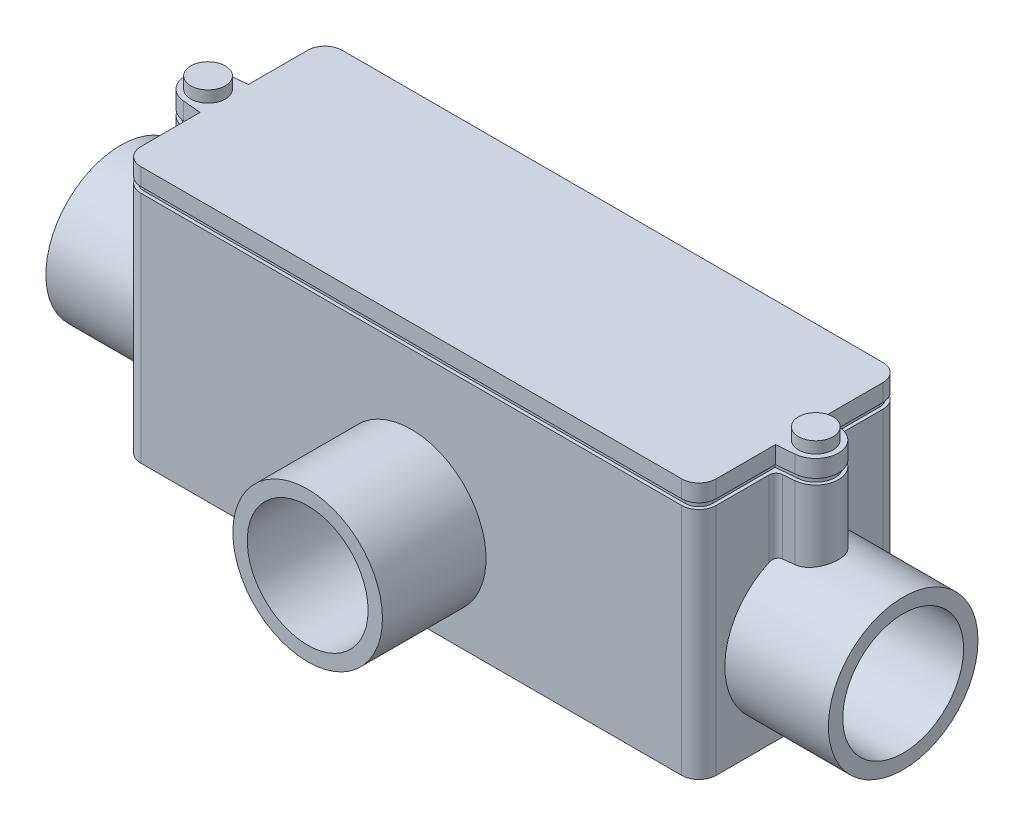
from build123d import *

# Parameters (mm, degrees)
SKETCH2_W                        = 127
SKETCH2_H                        = 44.45
BASE_EXTRUDE_DEPTH               = 51.6128
FILLET1_R                        = 3.81
SHELL1_T                         = -3.556
SKETCH1_R                        = 16.51
CONDUITBOSS_EXTRUDE1_DEPTH       = 22.86
COVERSCREWBOSS_EXTRUDE6_DEPTH    = 20
SKETCH18_R                       = 16.51
SIDECONDUITBOSS_EXTRUDE2_DEPTH   = 22.86
SKETCH10_R                       = 13.335
CONDUITSOCKET_CUT_EXTRUDE4_DEPTH = 19.8374
SKETCH16_R                       = 10.795
THRUDIA_CUT_EXTRUDE7_DEPTH       = 126.4666
SKETCH19_R                       = 13.335
CUT_EXTRUDE1_DEPTH               = 19.8374
SKETCH20_R                       = 10.795
CUT_EXTRUDE2_DEPTH               = 6.5786
FILLET2_R                        = 1.524
EXTRUDE2_DEPTH                   = 1.27
EXTRUDE3_START                   = 3.81
EXTRUDE3_DEPTH                   = 3.81
SKETCH25_R                       = 3.81
EXTRUDE4_DEPTH                   = 2.54


with BuildPart() as part:
    # Sketch2 → Base-Extrude (new body)
    with BuildSketch(Plane(origin=(0, 0, 0), x_dir=(1, 0, 0), z_dir=(0, 1, 0))):
        Rectangle(SKETCH2_W, SKETCH2_H)
    extrude(amount=BASE_EXTRUDE_DEPTH)

    # Fillet1
    fillet1_edges = [part.edges().sort_by_distance(p)[0] for p in [
        (-63.5, 25.8064, -22.225),
        (63.5, 25.8064, -22.225),
        (63.5, 25.8064, 22.225),
        (-63.5, 25.8064, 22.225),
    ]]
    fillet(fillet1_edges, radius=FILLET1_R)

    # Shell1
    shell1_openings = [part.faces().sort_by_distance(p)[0] for p in [
        (0, 51.6128, 0),
    ]]
    offset(amount=SHELL1_T, openings=shell1_openings, kind=Kind.INTERSECTION)

    # Sketch1 → ConduitBoss-Extrude1 (add)
    with BuildSketch(Plane(origin=(63.5, 0, 0), x_dir=(0, 0, -1), z_dir=(1, 0, 0))):
        with Locations(Location((0, 19.812, 0), (0, 0, 180))):
            Circle(SKETCH1_R)
    conduitboss_extrude1 = extrude(amount=CONDUITBOSS_EXTRUDE1_DEPTH)

    # Sketch5 → CoverScrewBoss-Extrude6 (add)
    with BuildSketch(Plane(origin=(0, 51.6128, 0), x_dir=(-1, 0, 0), z_dir=(0, 1, 0))):
        with BuildLine():
            Line((-63.5, -5.334), (-63.5, 5.334))
            Line((-63.5, 5.334), (-67.507785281, 4.980683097))
            ThreePointArc((-67.507785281, 4.980683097), (-72.0687, 0), (-67.507785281, -4.980683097))
            Line((-67.507785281, -4.980683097), (-63.5, -5.334))
        make_face()
        with BuildLine():
            Line((63.5, 5.334), (67.507785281, 4.980683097))
            ThreePointArc((67.507785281, 4.980683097), (72.0687, 0), (67.507785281, -4.980683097))
            Line((67.507785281, -4.980683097), (63.5, -5.334))
            Line((63.5, -5.334), (63.5, 5.334))
        make_face()
    extrude(amount=-COVERSCREWBOSS_EXTRUDE6_DEPTH)

    # Sketch18 → SideConduitBoss-Extrude2 (add)
    with BuildSketch(Plane.XY.offset(22.225)):
        with Locations(Location((0, 19.812, 0), (0, 0, 180))):
            Circle(SKETCH18_R)
    extrude(amount=SIDECONDUITBOSS_EXTRUDE2_DEPTH)

    # Sketch10 → ConduitSocket-Cut-Extrude4 (cut)
    with BuildSketch(Plane(origin=(86.36, 0, 0), x_dir=(0, 0, -1), z_dir=(1, 0, 0))):
        with Locations((0, 19.812)):
            Circle(SKETCH10_R)
    conduitsocket_cut_extrude4 = extrude(amount=-CONDUITSOCKET_CUT_EXTRUDE4_DEPTH, mode=Mode.SUBTRACT)

    # Sketch16 → ThruDia-Cut-Extrude7 (cut)
    with BuildSketch(Plane.YZ.offset(66.5226)):
        with Locations(Location((19.812, 0, 0), (0, 0, 270))):
            Circle(SKETCH16_R)
    thrudia_cut_extrude7 = extrude(amount=-THRUDIA_CUT_EXTRUDE7_DEPTH, mode=Mode.SUBTRACT)

    # Mirror1: ConduitBoss-Extrude1, ConduitSocket-Cut-Extrude4, ThruDia-Cut-Extrude7 across plane
    add(conduitboss_extrude1.mirror(Plane(origin=(0, 0, 0), x_dir=(0, 0, 1), z_dir=(1, 0, 0))))
    add(conduitsocket_cut_extrude4.mirror(Plane(origin=(0, 0, 0), x_dir=(0, 0, 1), z_dir=(1, 0, 0))), mode=Mode.SUBTRACT)
    add(thrudia_cut_extrude7.mirror(Plane(origin=(0, 0, 0), x_dir=(0, 0, 1), z_dir=(1, 0, 0))), mode=Mode.SUBTRACT)

    # Sketch19 → Cut-Extrude1 (cut)
    with BuildSketch(Plane.XY.offset(45.085)):
        with Locations((0, 19.812)):
            Circle(SKETCH19_R)
    extrude(amount=-CUT_EXTRUDE1_DEPTH, mode=Mode.SUBTRACT)

    # Sketch20 → Cut-Extrude2 (cut)
    with BuildSketch(Plane.XY.offset(25.2476)):
        with Locations((0, 19.812)):
            Circle(SKETCH20_R)
    extrude(amount=-CUT_EXTRUDE2_DEPTH, mode=Mode.SUBTRACT)

    # Fillet2
    fillet2_edges = [part.edges().sort_by_distance(p)[0] for p in [
        (63.5, 43.524706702, 5.334),
        (63.5, 43.524706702, -5.334),
        (-63.5, 43.524706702, -5.334),
        (-63.5, 43.524706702, 5.334),
    ]]
    fillet(fillet2_edges, radius=FILLET2_R)

    # Sketch23 → Extrude2 (add)
    with BuildSketch(Plane(origin=(0, 51.6128, 0), x_dir=(-1, 0, 0), z_dir=(0, 1, 0))):
        with BuildLine():
            Line((62.738, 4.63622081), (62.738, 18.415))
            ThreePointArc((62.738, 18.415), (61.845261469, 20.570261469), (59.69, 21.463))
            Line((59.69, 21.463), (-59.69, 21.463))
            ThreePointArc((-59.69, 21.463), (-61.845261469, 20.570261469), (-62.738, 18.415))
            Line((-62.738, 18.415), (-62.738, 4.63622081))
            Line((-62.738, 4.63622081), (-67.440868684, 4.221626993))
            ThreePointArc((-67.440868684, 4.221626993), (-71.3067, 0), (-67.440868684, -4.221626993))
            Line((-67.440868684, -4.221626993), (-62.738, -4.63622081))
            Line((-62.738, -4.63622081), (-62.738, -18.415))
            ThreePointArc((-62.738, -18.415), (-61.845261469, -20.570261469), (-59.69, -21.463))
            Line((-59.69, -21.463), (59.69, -21.463))
            ThreePointArc((59.69, -21.463), (61.845261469, -20.570261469), (62.738, -18.415))
            Line((62.738, -18.415), (62.738, -4.63622081))
            Line((62.738, -4.63622081), (67.440868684, -4.221626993))
            ThreePointArc((67.440868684, -4.221626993), (71.3067, 0), (67.440868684, 4.221626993))
            Line((67.440868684, 4.221626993), (62.738, 4.63622081))
        make_face()
    extrude(amount=EXTRUDE2_DEPTH)

    # Sketch24 → Extrude3 (add)
    with BuildSketch(Plane(origin=(0, 52.8828, 0), x_dir=(-1, 0, 0), z_dir=(0, 1, 0)).offset(EXTRUDE3_START)):
        with BuildLine():
            Line((-63.5, -5.334), (-63.5, -18.415))
            ThreePointArc((-63.5, -18.415), (-62.384076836, -21.109076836), (-59.69, -22.225))
            Line((-59.69, -22.225), (59.69, -22.225))
            ThreePointArc((59.69, -22.225), (62.384076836, -21.109076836), (63.5, -18.415))
            Line((63.5, -18.415), (63.5, -5.334))
            Line((63.5, -5.334), (67.507785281, -4.980683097))
            ThreePointArc((67.507785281, -4.980683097), (72.0687, 0), (67.507785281, 4.980683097))
            Line((67.507785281, 4.980683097), (63.5, 5.334))
            Line((63.5, 5.334), (63.5, 18.415))
            ThreePointArc((63.5, 18.415), (62.384076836, 21.109076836), (59.69, 22.225))
            Line((59.69, 22.225), (-59.69, 22.225))
            ThreePointArc((-59.69, 22.225), (-62.384076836, 21.109076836), (-63.5, 18.415))
            Line((-63.5, 18.415), (-63.5, 5.334))
            Line((-63.5, 5.334), (-67.507785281, 4.980683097))
            ThreePointArc((-67.507785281, 4.980683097), (-72.0687, 0), (-67.507785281, -4.980683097))
            Line((-67.507785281, -4.980683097), (-63.5, -5.334))
        make_face()
    extrude(amount=-EXTRUDE3_DEPTH)

    # Sketch25 → Extrude4 (add)
    with BuildSketch(Plane(origin=(0, 56.6928, 0), x_dir=(-1, 0, 0), z_dir=(0, 1, 0))):
        with Locations(Location((67.0687, 0, 0), (0, 0, 90))):
            Circle(SKETCH25_R)
        with Locations(Location((-67.0687, 0, 0), (0, 0, 90))):
            Circle(SKETCH25_R)
    extrude(amount=EXTRUDE4_DEPTH)


solid = part.part
